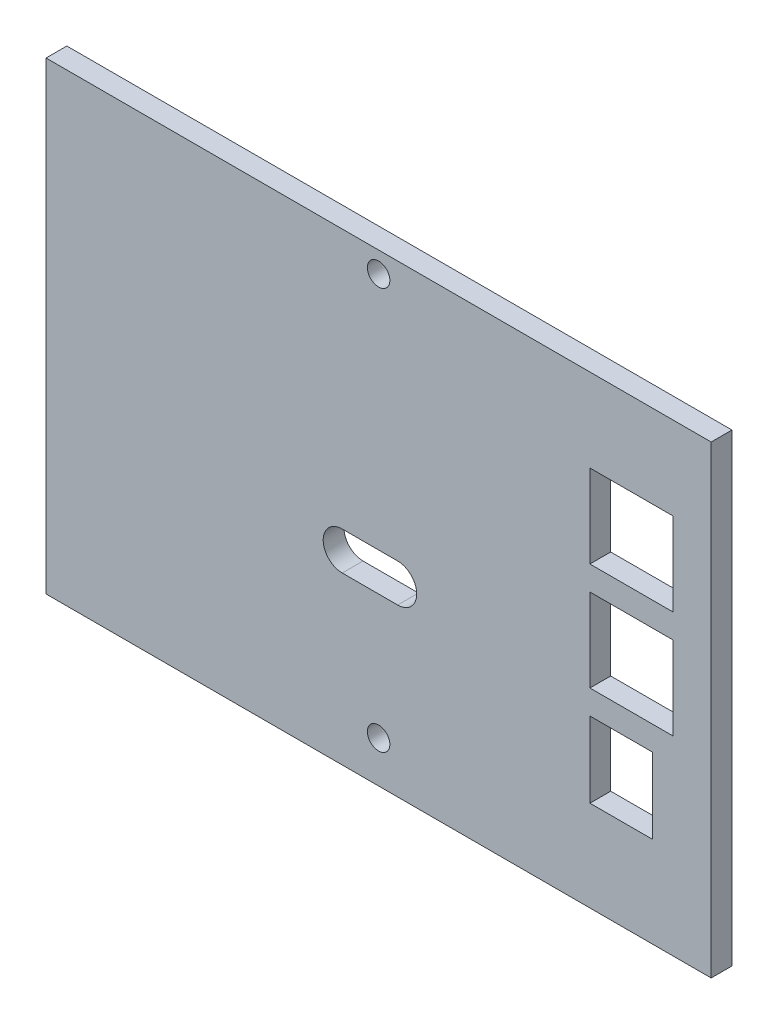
from build123d import *

# Parameters (mm, degrees)
CROQUIS6_W              = 96
CROQUIS6_H              = 67
SALIENTE_EXTRUIR1_DEPTH = 3
CROQUIS7_R              = 1.625
CROQUIS7_W              = 12
CROQUIS7_H              = 12
CROQUIS7_W_2            = 9
CROQUIS7_H_2            = 10.9
CORTAR_EXTRUIR1_DEPTH   = 59.611005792


with BuildPart() as part:
    # Croquis6 → Saliente-Extruir1 (new body)
    with BuildSketch(Plane.XY):
        Rectangle(CROQUIS6_W, CROQUIS6_H)
    extrude(amount=SALIENTE_EXTRUIR1_DEPTH)

    # Croquis7 → Cortar-Extruir1 (cut, through all)
    with BuildSketch(Plane.XY):
        with Locations((0, -27.5)):
            Circle(CROQUIS7_R)
        with Locations((0, 30.5)):
            Circle(CROQUIS7_R)
        with Locations((36.5, 15.5)):
            Rectangle(CROQUIS7_W, CROQUIS7_H)
        with Locations((36.5, 0)):
            Rectangle(CROQUIS7_W, CROQUIS7_H)
        with Locations((35, -14.95)):
            Rectangle(CROQUIS7_W_2, CROQUIS7_H_2)
        with BuildLine():
            Line((2.75, -9.5), (-5.25, -9.5))
            ThreePointArc((-5.25, -9.5), (-8, -6.75), (-5.25, -4))
            Line((-5.25, -4), (2.75, -4))
            ThreePointArc((2.75, -4), (5.5, -6.75), (2.75, -9.5))
        make_face()
    extrude(amount=CORTAR_EXTRUIR1_DEPTH, mode=Mode.SUBTRACT)


solid = part.part
